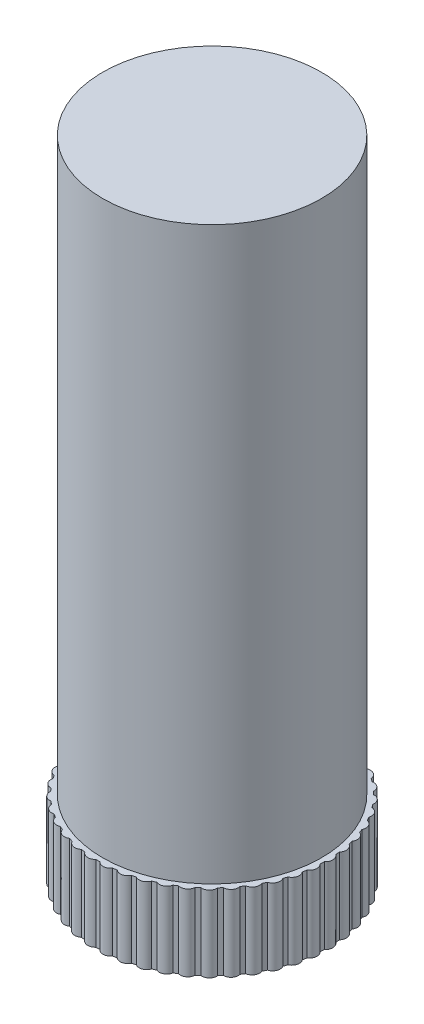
from build123d import *

# Parameters (mm, degrees)
SKETCH_2_R          = 0.394604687
EXTRUDE_1_DEPTH     = 4
EXTRUDE_1_2_DEPTH   = 4
EXTRUDE_1_3_DEPTH   = 4
EXTRUDE_1_4_DEPTH   = 4
EXTRUDE_1_5_DEPTH   = 4
EXTRUDE_1_6_DEPTH   = 4
EXTRUDE_1_7_DEPTH   = 4
EXTRUDE_1_8_DEPTH   = 4
EXTRUDE_1_9_DEPTH   = 4
EXTRUDE_1_10_DEPTH  = 4
EXTRUDE_1_11_DEPTH  = 4
EXTRUDE_1_12_DEPTH  = 4
EXTRUDE_1_13_DEPTH  = 4
EXTRUDE_1_14_DEPTH  = 4
EXTRUDE_1_15_DEPTH  = 4
EXTRUDE_1_16_DEPTH  = 4
EXTRUDE_1_17_DEPTH  = 4
EXTRUDE_1_18_DEPTH  = 4
EXTRUDE_1_19_DEPTH  = 4
EXTRUDE_1_20_DEPTH  = 4
EXTRUDE_1_21_DEPTH  = 4
EXTRUDE_1_22_DEPTH  = 4
EXTRUDE_1_23_DEPTH  = 4
EXTRUDE_1_24_DEPTH  = 4
EXTRUDE_1_25_DEPTH  = 4
EXTRUDE_1_26_DEPTH  = 4
EXTRUDE_1_27_DEPTH  = 4
EXTRUDE_1_28_DEPTH  = 4
EXTRUDE_1_29_DEPTH  = 4
EXTRUDE_1_30_DEPTH  = 4
EXTRUDE_1_31_DEPTH  = 4
EXTRUDE_1_32_DEPTH  = 4
EXTRUDE_1_33_DEPTH  = 4
EXTRUDE_1_34_DEPTH  = 4
EXTRUDE_1_35_DEPTH  = 4
EXTRUDE_1_36_DEPTH  = 4
EXTRUDE_1_37_DEPTH  = 4
EXTRUDE_1_38_DEPTH  = 4
EXTRUDE_1_39_DEPTH  = 4
EXTRUDE_1_40_DEPTH  = 4
EXTRUDE_1_41_DEPTH  = 4
EXTRUDE_1_42_DEPTH  = 4
EXTRUDE_1_43_DEPTH  = 4
EXTRUDE_1_44_DEPTH  = 4
EXTRUDE_1_45_DEPTH  = 4
SKETCH_3_R          = 6
EXTRUDE_2_DEPTH     = 4
SKETCH_4_R          = 5.75
EXTRUDE_3_DEPTH     = 30
SKETCH_5_R          = 3.5
CUT_EXTRUDE_1_DEPTH = 4
SKETCH_6_R          = 1.424249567
CUT_EXTRUDE_2_DEPTH = 2


with BuildPart() as part:
    # Sketch 2 → Extrude 1 (new body)
    with BuildSketch(Plane(origin=(0, 0, 0), x_dir=(1, 0, 0), z_dir=(0, 1, 0))):
        with Locations(Location((0, 5.75, 0), (0, 0, 270))):
            Circle(SKETCH_2_R)
    extrude(amount=EXTRUDE_1_DEPTH)



with BuildPart() as body_2:
    # Sketch 2 → Extrude 1 2 (new body)
    with BuildSketch(Plane(origin=(0, 0, 0), x_dir=(1, 0, 0), z_dir=(0, 1, 0))):
        with Locations(Location((0.800245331, 5.694041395, 0), (0, 0, 270))):
            Circle(SKETCH_2_R)
    extrude(amount=EXTRUDE_1_2_DEPTH)


with BuildPart() as body_3:
    # Sketch 2 → Extrude 1 3 (new body)
    with BuildSketch(Plane(origin=(0, 0, 0), x_dir=(1, 0, 0), z_dir=(0, 1, 0))):
        with Locations(Location((1.584914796, 5.527254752, 0), (0, 0, 270))):
            Circle(SKETCH_2_R)
    extrude(amount=EXTRUDE_1_3_DEPTH)


with BuildPart() as body_4:
    # Sketch 2 → Extrude 1 4 (new body)
    with BuildSketch(Plane(origin=(0, 0, 0), x_dir=(1, 0, 0), z_dir=(0, 1, 0))):
        with Locations(Location((2.338735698, 5.252886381, 0), (0, 0, 270))):
            Circle(SKETCH_2_R)
    extrude(amount=EXTRUDE_1_4_DEPTH)


with BuildPart() as body_5:
    # Sketch 2 → Extrude 1 5 (new body)
    with BuildSketch(Plane(origin=(0, 0, 0), x_dir=(1, 0, 0), z_dir=(0, 1, 0))):
        with Locations(Location((3.047035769, 4.876276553, 0), (0, 0, 270))):
            Circle(SKETCH_2_R)
    extrude(amount=EXTRUDE_1_5_DEPTH)


with BuildPart() as body_6:
    # Sketch 2 → Extrude 1 6 (new body)
    with BuildSketch(Plane(origin=(0, 0, 0), x_dir=(1, 0, 0), z_dir=(0, 1, 0))):
        with Locations(Location((3.696028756, 4.404755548, 0), (0, 0, 270))):
            Circle(SKETCH_2_R)
    extrude(amount=EXTRUDE_1_6_DEPTH)


with BuildPart() as body_7:
    # Sketch 2 → Extrude 1 7 (new body)
    with BuildSketch(Plane(origin=(0, 0, 0), x_dir=(1, 0, 0), z_dir=(0, 1, 0))):
        with Locations(Location((4.273082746, 3.847500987, 0), (0, 0, 270))):
            Circle(SKETCH_2_R)
    extrude(amount=EXTRUDE_1_7_DEPTH)


with BuildPart() as body_8:
    # Sketch 2 → Extrude 1 8 (new body)
    with BuildSketch(Plane(origin=(0, 0, 0), x_dir=(1, 0, 0), z_dir=(0, 1, 0))):
        with Locations(Location((4.766966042, 3.215359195, 0), (0, 0, 270))):
            Circle(SKETCH_2_R)
    extrude(amount=EXTRUDE_1_8_DEPTH)


with BuildPart() as body_9:
    # Sketch 2 → Extrude 1 9 (new body)
    with BuildSketch(Plane(origin=(0, 0, 0), x_dir=(1, 0, 0), z_dir=(0, 1, 0))):
        with Locations(Location((5.168065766, 2.520634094, 0), (0, 0, 270))):
            Circle(SKETCH_2_R)
    extrude(amount=EXTRUDE_1_9_DEPTH)


with BuildPart() as body_10:
    # Sketch 2 → Extrude 1 10 (new body)
    with BuildSketch(Plane(origin=(0, 0, 0), x_dir=(1, 0, 0), z_dir=(0, 1, 0))):
        with Locations(Location((5.468574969, 1.776847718, 0), (0, 0, 270))):
            Circle(SKETCH_2_R)
    extrude(amount=EXTRUDE_1_10_DEPTH)


with BuildPart() as body_11:
    # Sketch 2 → Extrude 1 11 (new body)
    with BuildSketch(Plane(origin=(0, 0, 0), x_dir=(1, 0, 0), z_dir=(0, 1, 0))):
        with Locations(Location((5.66264458, 0.998477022, 0), (0, 0, 270))):
            Circle(SKETCH_2_R)
    extrude(amount=EXTRUDE_1_11_DEPTH)


with BuildPart() as body_12:
    # Sketch 2 → Extrude 1 12 (new body)
    with BuildSketch(Plane(origin=(0, 0, 0), x_dir=(1, 0, 0), z_dir=(0, 1, 0))):
        with Locations(Location((5.746497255, 0.200672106, 0), (0, 0, 270))):
            Circle(SKETCH_2_R)
    extrude(amount=EXTRUDE_1_12_DEPTH)


with BuildPart() as body_13:
    # Sketch 2 → Extrude 1 13 (new body)
    with BuildSketch(Plane(origin=(0, 0, 0), x_dir=(1, 0, 0), z_dir=(0, 1, 0))):
        with Locations(Location((5.718500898, -0.601038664, 0), (0, 0, 270))):
            Circle(SKETCH_2_R)
    extrude(amount=EXTRUDE_1_13_DEPTH)


with BuildPart() as body_14:
    # Sketch 2 → Extrude 1 14 (new body)
    with BuildSketch(Plane(origin=(0, 0, 0), x_dir=(1, 0, 0), z_dir=(0, 1, 0))):
        with Locations(Location((5.579200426, -1.3910509, 0), (0, 0, 270))):
            Circle(SKETCH_2_R)
    extrude(amount=EXTRUDE_1_14_DEPTH)


with BuildPart() as body_15:
    # Sketch 2 → Extrude 1 15 (new body)
    with BuildSketch(Plane(origin=(0, 0, 0), x_dir=(1, 0, 0), z_dir=(0, 1, 0))):
        with Locations(Location((5.331307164, -2.153987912, 0), (0, 0, 270))):
            Circle(SKETCH_2_R)
    extrude(amount=EXTRUDE_1_15_DEPTH)


with BuildPart() as body_16:
    # Sketch 2 → Extrude 1 16 (new body)
    with BuildSketch(Plane(origin=(0, 0, 0), x_dir=(1, 0, 0), z_dir=(0, 1, 0))):
        with Locations(Location((4.979646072, -2.875, 0), (0, 0, 270))):
            Circle(SKETCH_2_R)
    extrude(amount=EXTRUDE_1_16_DEPTH)


with BuildPart() as body_17:
    # Sketch 2 → Extrude 1 17 (new body)
    with BuildSketch(Plane(origin=(0, 0, 0), x_dir=(1, 0, 0), z_dir=(0, 1, 0))):
        with Locations(Location((4.531061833, -3.540053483, 0), (0, 0, 270))):
            Circle(SKETCH_2_R)
    extrude(amount=EXTRUDE_1_17_DEPTH)


with BuildPart() as body_18:
    # Sketch 2 → Extrude 1 18 (new body)
    with BuildSketch(Plane(origin=(0, 0, 0), x_dir=(1, 0, 0), z_dir=(0, 1, 0))):
        with Locations(Location((3.99428563, -4.136203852, 0), (0, 0, 270))):
            Circle(SKETCH_2_R)
    extrude(amount=EXTRUDE_1_18_DEPTH)


with BuildPart() as body_19:
    # Sketch 2 → Extrude 1 19 (new body)
    with BuildSketch(Plane(origin=(0, 0, 0), x_dir=(1, 0, 0), z_dir=(0, 1, 0))):
        with Locations(Location((3.379765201, -4.651847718, 0), (0, 0, 270))):
            Circle(SKETCH_2_R)
    extrude(amount=EXTRUDE_1_19_DEPTH)


with BuildPart() as body_20:
    # Sketch 2 → Extrude 1 20 (new body)
    with BuildSketch(Plane(origin=(0, 0, 0), x_dir=(1, 0, 0), z_dir=(0, 1, 0))):
        with Locations(Location((2.699461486, -5.076948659, 0), (0, 0, 270))):
            Circle(SKETCH_2_R)
    extrude(amount=EXTRUDE_1_20_DEPTH)


with BuildPart() as body_21:
    # Sketch 2 → Extrude 1 21 (new body)
    with BuildSketch(Plane(origin=(0, 0, 0), x_dir=(1, 0, 0), z_dir=(0, 1, 0))):
        with Locations(Location((1.966615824, -5.40323257, 0), (0, 0, 270))):
            Circle(SKETCH_2_R)
    extrude(amount=EXTRUDE_1_21_DEPTH)


with BuildPart() as body_22:
    # Sketch 2 → Extrude 1 22 (new body)
    with BuildSketch(Plane(origin=(0, 0, 0), x_dir=(1, 0, 0), z_dir=(0, 1, 0))):
        with Locations(Location((1.195492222, -5.624348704, 0), (0, 0, 270))):
            Circle(SKETCH_2_R)
    extrude(amount=EXTRUDE_1_22_DEPTH)


with BuildPart() as body_23:
    # Sketch 2 → Extrude 1 23 (new body)
    with BuildSketch(Plane(origin=(0, 0, 0), x_dir=(1, 0, 0), z_dir=(0, 1, 0))):
        with Locations(Location((0.401099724, -5.735993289, 0), (0, 0, 270))):
            Circle(SKETCH_2_R)
    extrude(amount=EXTRUDE_1_23_DEPTH)


with BuildPart() as body_24:
    # Sketch 2 → Extrude 1 24 (new body)
    with BuildSketch(Plane(origin=(0, 0, 0), x_dir=(1, 0, 0), z_dir=(0, 1, 0))):
        with Locations(Location((-0.401099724, -5.735993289, 0), (0, 0, 270))):
            Circle(SKETCH_2_R)
    extrude(amount=EXTRUDE_1_24_DEPTH)


with BuildPart() as body_25:
    # Sketch 2 → Extrude 1 25 (new body)
    with BuildSketch(Plane(origin=(0, 0, 0), x_dir=(1, 0, 0), z_dir=(0, 1, 0))):
        with Locations(Location((-1.195492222, -5.624348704, 0), (0, 0, 270))):
            Circle(SKETCH_2_R)
    extrude(amount=EXTRUDE_1_25_DEPTH)


with BuildPart() as body_26:
    # Sketch 2 → Extrude 1 26 (new body)
    with BuildSketch(Plane(origin=(0, 0, 0), x_dir=(1, 0, 0), z_dir=(0, 1, 0))):
        with Locations(Location((-1.966615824, -5.40323257, 0), (0, 0, 270))):
            Circle(SKETCH_2_R)
    extrude(amount=EXTRUDE_1_26_DEPTH)


with BuildPart() as body_27:
    # Sketch 2 → Extrude 1 27 (new body)
    with BuildSketch(Plane(origin=(0, 0, 0), x_dir=(1, 0, 0), z_dir=(0, 1, 0))):
        with Locations(Location((-2.699461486, -5.076948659, 0), (0, 0, 270))):
            Circle(SKETCH_2_R)
    extrude(amount=EXTRUDE_1_27_DEPTH)


with BuildPart() as body_28:
    # Sketch 2 → Extrude 1 28 (new body)
    with BuildSketch(Plane(origin=(0, 0, 0), x_dir=(1, 0, 0), z_dir=(0, 1, 0))):
        with Locations(Location((-3.379765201, -4.651847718, 0), (0, 0, 270))):
            Circle(SKETCH_2_R)
    extrude(amount=EXTRUDE_1_28_DEPTH)


with BuildPart() as body_29:
    # Sketch 2 → Extrude 1 29 (new body)
    with BuildSketch(Plane(origin=(0, 0, 0), x_dir=(1, 0, 0), z_dir=(0, 1, 0))):
        with Locations(Location((-3.99428563, -4.136203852, 0), (0, 0, 270))):
            Circle(SKETCH_2_R)
    extrude(amount=EXTRUDE_1_29_DEPTH)


with BuildPart() as body_30:
    # Sketch 2 → Extrude 1 30 (new body)
    with BuildSketch(Plane(origin=(0, 0, 0), x_dir=(1, 0, 0), z_dir=(0, 1, 0))):
        with Locations(Location((-4.531061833, -3.540053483, 0), (0, 0, 270))):
            Circle(SKETCH_2_R)
    extrude(amount=EXTRUDE_1_30_DEPTH)


with BuildPart() as body_31:
    # Sketch 2 → Extrude 1 31 (new body)
    with BuildSketch(Plane(origin=(0, 0, 0), x_dir=(1, 0, 0), z_dir=(0, 1, 0))):
        with Locations(Location((-4.979646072, -2.875, 0), (0, 0, 270))):
            Circle(SKETCH_2_R)
    extrude(amount=EXTRUDE_1_31_DEPTH)


with BuildPart() as body_32:
    # Sketch 2 → Extrude 1 32 (new body)
    with BuildSketch(Plane(origin=(0, 0, 0), x_dir=(1, 0, 0), z_dir=(0, 1, 0))):
        with Locations(Location((-5.331307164, -2.153987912, 0), (0, 0, 270))):
            Circle(SKETCH_2_R)
    extrude(amount=EXTRUDE_1_32_DEPTH)


with BuildPart() as body_33:
    # Sketch 2 → Extrude 1 33 (new body)
    with BuildSketch(Plane(origin=(0, 0, 0), x_dir=(1, 0, 0), z_dir=(0, 1, 0))):
        with Locations(Location((-5.579200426, -1.3910509, 0), (0, 0, 270))):
            Circle(SKETCH_2_R)
    extrude(amount=EXTRUDE_1_33_DEPTH)


with BuildPart() as body_34:
    # Sketch 2 → Extrude 1 34 (new body)
    with BuildSketch(Plane(origin=(0, 0, 0), x_dir=(1, 0, 0), z_dir=(0, 1, 0))):
        with Locations(Location((-5.718500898, -0.601038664, 0), (0, 0, 270))):
            Circle(SKETCH_2_R)
    extrude(amount=EXTRUDE_1_34_DEPTH)


with BuildPart() as body_35:
    # Sketch 2 → Extrude 1 35 (new body)
    with BuildSketch(Plane(origin=(0, 0, 0), x_dir=(1, 0, 0), z_dir=(0, 1, 0))):
        with Locations(Location((-5.746497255, 0.200672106, 0), (0, 0, 270))):
            Circle(SKETCH_2_R)
    extrude(amount=EXTRUDE_1_35_DEPTH)


with BuildPart() as body_36:
    # Sketch 2 → Extrude 1 36 (new body)
    with BuildSketch(Plane(origin=(0, 0, 0), x_dir=(1, 0, 0), z_dir=(0, 1, 0))):
        with Locations(Location((-5.66264458, 0.998477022, 0), (0, 0, 270))):
            Circle(SKETCH_2_R)
    extrude(amount=EXTRUDE_1_36_DEPTH)


with BuildPart() as body_37:
    # Sketch 2 → Extrude 1 37 (new body)
    with BuildSketch(Plane(origin=(0, 0, 0), x_dir=(1, 0, 0), z_dir=(0, 1, 0))):
        with Locations(Location((-5.468574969, 1.776847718, 0), (0, 0, 270))):
            Circle(SKETCH_2_R)
    extrude(amount=EXTRUDE_1_37_DEPTH)


with BuildPart() as body_38:
    # Sketch 2 → Extrude 1 38 (new body)
    with BuildSketch(Plane(origin=(0, 0, 0), x_dir=(1, 0, 0), z_dir=(0, 1, 0))):
        with Locations(Location((-5.168065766, 2.520634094, 0), (0, 0, 270))):
            Circle(SKETCH_2_R)
    extrude(amount=EXTRUDE_1_38_DEPTH)


with BuildPart() as body_39:
    # Sketch 2 → Extrude 1 39 (new body)
    with BuildSketch(Plane(origin=(0, 0, 0), x_dir=(1, 0, 0), z_dir=(0, 1, 0))):
        with Locations(Location((-4.766966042, 3.215359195, 0), (0, 0, 270))):
            Circle(SKETCH_2_R)
    extrude(amount=EXTRUDE_1_39_DEPTH)


with BuildPart() as body_40:
    # Sketch 2 → Extrude 1 40 (new body)
    with BuildSketch(Plane(origin=(0, 0, 0), x_dir=(1, 0, 0), z_dir=(0, 1, 0))):
        with Locations(Location((-4.273082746, 3.847500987, 0), (0, 0, 270))):
            Circle(SKETCH_2_R)
    extrude(amount=EXTRUDE_1_40_DEPTH)


with BuildPart() as body_41:
    # Sketch 2 → Extrude 1 41 (new body)
    with BuildSketch(Plane(origin=(0, 0, 0), x_dir=(1, 0, 0), z_dir=(0, 1, 0))):
        with Locations(Location((-3.696028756, 4.404755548, 0), (0, 0, 270))):
            Circle(SKETCH_2_R)
    extrude(amount=EXTRUDE_1_41_DEPTH)


with BuildPart() as body_42:
    # Sketch 2 → Extrude 1 42 (new body)
    with BuildSketch(Plane(origin=(0, 0, 0), x_dir=(1, 0, 0), z_dir=(0, 1, 0))):
        with Locations(Location((-3.047035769, 4.876276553, 0), (0, 0, 270))):
            Circle(SKETCH_2_R)
    extrude(amount=EXTRUDE_1_42_DEPTH)


with BuildPart() as body_43:
    # Sketch 2 → Extrude 1 43 (new body)
    with BuildSketch(Plane(origin=(0, 0, 0), x_dir=(1, 0, 0), z_dir=(0, 1, 0))):
        with Locations(Location((-2.338735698, 5.252886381, 0), (0, 0, 270))):
            Circle(SKETCH_2_R)
    extrude(amount=EXTRUDE_1_43_DEPTH)


with BuildPart() as body_44:
    # Sketch 2 → Extrude 1 44 (new body)
    with BuildSketch(Plane(origin=(0, 0, 0), x_dir=(1, 0, 0), z_dir=(0, 1, 0))):
        with Locations(Location((-1.584914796, 5.527254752, 0), (0, 0, 270))):
            Circle(SKETCH_2_R)
    extrude(amount=EXTRUDE_1_44_DEPTH)


with BuildPart() as body_45:
    # Sketch 2 → Extrude 1 45 (new body)
    with BuildSketch(Plane(origin=(0, 0, 0), x_dir=(1, 0, 0), z_dir=(0, 1, 0))):
        with Locations(Location((-0.800245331, 5.694041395, 0), (0, 0, 270))):
            Circle(SKETCH_2_R)
    extrude(amount=EXTRUDE_1_45_DEPTH)


with BuildPart() as part_1:
    add(part.part)

    add(body_2.part)  # Extrude 2 merges body 2

    add(body_3.part)  # Extrude 2 merges body 3

    add(body_4.part)  # Extrude 2 merges body 4

    add(body_5.part)  # Extrude 2 merges body 5

    add(body_6.part)  # Extrude 2 merges body 6

    add(body_7.part)  # Extrude 2 merges body 7

    add(body_8.part)  # Extrude 2 merges body 8

    add(body_9.part)  # Extrude 2 merges body 9

    add(body_10.part)  # Extrude 2 merges body 10

    add(body_11.part)  # Extrude 2 merges body 11

    add(body_12.part)  # Extrude 2 merges body 12

    add(body_13.part)  # Extrude 2 merges body 13

    add(body_14.part)  # Extrude 2 merges body 14

    add(body_15.part)  # Extrude 2 merges body 15

    add(body_16.part)  # Extrude 2 merges body 16

    add(body_17.part)  # Extrude 2 merges body 17

    add(body_18.part)  # Extrude 2 merges body 18

    add(body_19.part)  # Extrude 2 merges body 19

    add(body_20.part)  # Extrude 2 merges body 20

    add(body_21.part)  # Extrude 2 merges body 21

    add(body_22.part)  # Extrude 2 merges body 22

    add(body_23.part)  # Extrude 2 merges body 23

    add(body_24.part)  # Extrude 2 merges body 24

    add(body_25.part)  # Extrude 2 merges body 25

    add(body_26.part)  # Extrude 2 merges body 26

    add(body_27.part)  # Extrude 2 merges body 27

    add(body_28.part)  # Extrude 2 merges body 28

    add(body_29.part)  # Extrude 2 merges body 29

    add(body_30.part)  # Extrude 2 merges body 30

    add(body_31.part)  # Extrude 2 merges body 31

    add(body_32.part)  # Extrude 2 merges body 32

    add(body_33.part)  # Extrude 2 merges body 33

    add(body_34.part)  # Extrude 2 merges body 34

    add(body_35.part)  # Extrude 2 merges body 35

    add(body_36.part)  # Extrude 2 merges body 36

    add(body_37.part)  # Extrude 2 merges body 37

    add(body_38.part)  # Extrude 2 merges body 38

    add(body_39.part)  # Extrude 2 merges body 39

    add(body_40.part)  # Extrude 2 merges body 40

    add(body_41.part)  # Extrude 2 merges body 41

    add(body_42.part)  # Extrude 2 merges body 42

    add(body_43.part)  # Extrude 2 merges body 43

    add(body_44.part)  # Extrude 2 merges body 44

    add(body_45.part)  # Extrude 2 merges body 45
    # Sketch 3 → Extrude 2 (add)
    with BuildSketch(Plane.XZ):
        Circle(SKETCH_3_R)
    extrude(amount=-EXTRUDE_2_DEPTH)

    # Sketch 4 → Extrude 3 (add)
    with BuildSketch(Plane(origin=(0, 4, 0), x_dir=(1, 0, 0), z_dir=(0, 1, 0))):
        with Locations(Location((0, 0, 0), (0, 0, 270))):
            Circle(SKETCH_4_R)
    extrude(amount=EXTRUDE_3_DEPTH)

    # Sketch 5 → Cut-Extrude 1 (cut)
    with BuildSketch(Plane(origin=(0, 0, 0), x_dir=(-1, 0, 0), z_dir=(0, -1, 0))):
        with Locations(Location((0, 0, 0), (0, 0, 90))):
            Circle(SKETCH_5_R)
    extrude(amount=-CUT_EXTRUDE_1_DEPTH, mode=Mode.SUBTRACT)

    # Sketch 6 → Cut-Extrude 2 (cut)
    with BuildSketch(Plane(origin=(0, 4, 0), x_dir=(-1, 0, 0), z_dir=(0, -1, 0))):
        with Locations(Location((0, 0, 0), (0, 0, 90))):
            Circle(SKETCH_6_R)
    extrude(amount=-CUT_EXTRUDE_2_DEPTH, mode=Mode.SUBTRACT)


solid = part_1.part
